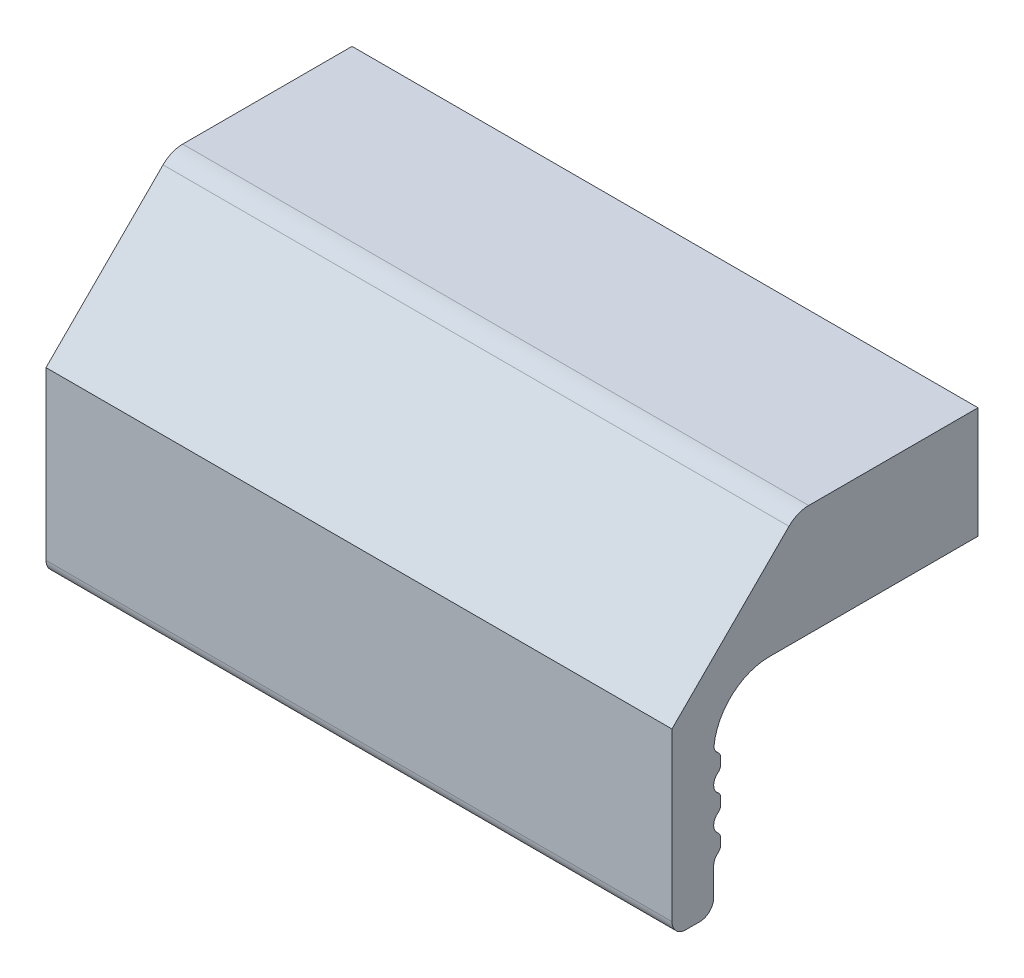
ISO-10303-21;
HEADER;
FILE_DESCRIPTION(('STEP AP214'),'2;1');
FILE_NAME('part.step','',(''),(''),'','','');
FILE_SCHEMA(('AUTOMOTIVE_DESIGN { 1 0 10303 214 1 1 1 1 }'));
ENDSEC;
DATA;
#1=APPLICATION_CONTEXT('core data for automotive mechanical design processes');
#2=APPLICATION_PROTOCOL_DEFINITION('international standard','automotive_design',2000,#1);
#3=PRODUCT_CONTEXT('',#1,'mechanical');
#4=PRODUCT('Part','Part','',(#3));
#5=PRODUCT_RELATED_PRODUCT_CATEGORY('part','',(#4));
#6=PRODUCT_DEFINITION_FORMATION('','',#4);
#7=PRODUCT_DEFINITION_CONTEXT('part definition',#1,'design');
#8=PRODUCT_DEFINITION('design','',#6,#7);
#9=PRODUCT_DEFINITION_SHAPE('','',#8);
#10=(LENGTH_UNIT() NAMED_UNIT(*) SI_UNIT(.MILLI.,.METRE.));
#11=(NAMED_UNIT(*) PLANE_ANGLE_UNIT() SI_UNIT($,.RADIAN.));
#12=(NAMED_UNIT(*) SI_UNIT($,.STERADIAN.) SOLID_ANGLE_UNIT());
#13=UNCERTAINTY_MEASURE_WITH_UNIT(LENGTH_MEASURE(1.E-05),#10,'distance_accuracy_value','');
#14=(GEOMETRIC_REPRESENTATION_CONTEXT(3) GLOBAL_UNCERTAINTY_ASSIGNED_CONTEXT((#13)) GLOBAL_UNIT_ASSIGNED_CONTEXT((#10,
#11,#12)) REPRESENTATION_CONTEXT('',''));
#15=CARTESIAN_POINT('',(0.,0.,0.));
#16=DIRECTION('',(0.,0.,1.));
#17=DIRECTION('',(1.,0.,0.));
#18=AXIS2_PLACEMENT_3D('',#15,#16,#17);
#19=CARTESIAN_POINT('',(37.5,-17.,22.));
#20=DIRECTION('',(0.,0.,1.));
#21=DIRECTION('',(1.,0.,0.));
#22=AXIS2_PLACEMENT_3D('',#19,#20,#21);
#23=PLANE('',#22);
#24=DIRECTION('',(-1.,0.,0.));
#25=VECTOR('',#24,1.);
#26=CARTESIAN_POINT('',(37.5,-17.,22.));
#27=LINE('',#26,#25);
#28=CARTESIAN_POINT('',(37.5,-17.,22.));
#29=VERTEX_POINT('',#28);
#30=CARTESIAN_POINT('',(-7.5,-17.,22.));
#31=VERTEX_POINT('',#30);
#32=EDGE_CURVE('E9',#29,#31,#27,.T.);
#33=ORIENTED_EDGE('',*,*,#32,.F.);
#34=DIRECTION('',(0.,1.,0.));
#35=VECTOR('',#34,1.);
#36=CARTESIAN_POINT('',(37.5,-17.,22.));
#37=LINE('',#36,#35);
#38=CARTESIAN_POINT('',(37.5,-5.,22.));
#39=VERTEX_POINT('',#38);
#40=EDGE_CURVE('E181',#29,#39,#37,.T.);
#41=ORIENTED_EDGE('',*,*,#40,.T.);
#42=DIRECTION('',(-1.,0.,0.));
#43=VECTOR('',#42,1.);
#44=CARTESIAN_POINT('',(37.5,-5.,22.));
#45=LINE('',#44,#43);
#46=CARTESIAN_POINT('',(-7.5,-5.,22.));
#47=VERTEX_POINT('',#46);
#48=EDGE_CURVE('E177',#39,#47,#45,.T.);
#49=ORIENTED_EDGE('',*,*,#48,.T.);
#50=DIRECTION('',(0.,1.,0.));
#51=VECTOR('',#50,1.);
#52=CARTESIAN_POINT('',(-7.5,-17.,22.));
#53=LINE('',#52,#51);
#54=EDGE_CURVE('E179',#31,#47,#53,.T.);
#55=ORIENTED_EDGE('',*,*,#54,.F.);
#56=EDGE_LOOP('',(#33,#41,#49,#55));
#57=FACE_BOUND('',#56,.T.);
#58=ADVANCED_FACE('F14',(#57),#23,.T.);
#59=CARTESIAN_POINT('',(37.5,-17.,21.));
#60=DIRECTION('',(-1.,0.,0.));
#61=DIRECTION('',(0.,0.,1.));
#62=AXIS2_PLACEMENT_3D('',#59,#60,#61);
#63=CYLINDRICAL_SURFACE('',#62,1.);
#64=DIRECTION('',(-1.,0.,0.));
#65=VECTOR('',#64,1.);
#66=CARTESIAN_POINT('',(37.5,-18.,21.));
#67=LINE('',#66,#65);
#68=CARTESIAN_POINT('',(37.5,-18.,21.));
#69=VERTEX_POINT('',#68);
#70=CARTESIAN_POINT('',(-7.5,-18.,21.));
#71=VERTEX_POINT('',#70);
#72=EDGE_CURVE('E22',#69,#71,#67,.T.);
#73=ORIENTED_EDGE('',*,*,#72,.F.);
#74=CARTESIAN_POINT('',(37.5,-17.,21.));
#75=DIRECTION('',(1.,0.,0.));
#76=DIRECTION('',(0.,0.,-1.));
#77=AXIS2_PLACEMENT_3D('',#74,#75,#76);
#78=CIRCLE('',#77,1.);
#79=EDGE_CURVE('E187',#29,#69,#78,.T.);
#80=ORIENTED_EDGE('',*,*,#79,.F.);
#81=ORIENTED_EDGE('',*,*,#32,.T.);
#82=CARTESIAN_POINT('',(-7.5,-17.,21.));
#83=DIRECTION('',(1.,0.,0.));
#84=DIRECTION('',(0.,0.,-1.));
#85=AXIS2_PLACEMENT_3D('',#82,#83,#84);
#86=CIRCLE('',#85,1.);
#87=EDGE_CURVE('E196',#31,#71,#86,.T.);
#88=ORIENTED_EDGE('',*,*,#87,.T.);
#89=EDGE_LOOP('',(#73,#80,#81,#88));
#90=FACE_BOUND('',#89,.T.);
#91=ADVANCED_FACE('F16',(#90),#63,.T.);
#92=CARTESIAN_POINT('',(37.5,-18.,20.));
#93=DIRECTION('',(0.,-1.,0.));
#94=DIRECTION('',(-1.,0.,0.));
#95=AXIS2_PLACEMENT_3D('',#92,#93,#94);
#96=PLANE('',#95);
#97=DIRECTION('',(-1.,0.,0.));
#98=VECTOR('',#97,1.);
#99=CARTESIAN_POINT('',(37.5,-18.,20.));
#100=LINE('',#99,#98);
#101=CARTESIAN_POINT('',(37.5,-18.,20.));
#102=VERTEX_POINT('',#101);
#103=CARTESIAN_POINT('',(-7.5,-18.,20.));
#104=VERTEX_POINT('',#103);
#105=EDGE_CURVE('E379',#102,#104,#100,.T.);
#106=ORIENTED_EDGE('',*,*,#105,.F.);
#107=DIRECTION('',(0.,0.,1.));
#108=VECTOR('',#107,1.);
#109=CARTESIAN_POINT('',(37.5,-18.,20.));
#110=LINE('',#109,#108);
#111=EDGE_CURVE('E334',#102,#69,#110,.T.);
#112=ORIENTED_EDGE('',*,*,#111,.T.);
#113=ORIENTED_EDGE('',*,*,#72,.T.);
#114=DIRECTION('',(0.,0.,1.));
#115=VECTOR('',#114,1.);
#116=CARTESIAN_POINT('',(-7.5,-18.,20.));
#117=LINE('',#116,#115);
#118=EDGE_CURVE('E265',#104,#71,#117,.T.);
#119=ORIENTED_EDGE('',*,*,#118,.F.);
#120=EDGE_LOOP('',(#106,#112,#113,#119));
#121=FACE_BOUND('',#120,.T.);
#122=ADVANCED_FACE('F382',(#121),#96,.T.);
#123=CARTESIAN_POINT('',(37.5,-17.,20.));
#124=DIRECTION('',(-1.,0.,0.));
#125=DIRECTION('',(0.,0.,1.));
#126=AXIS2_PLACEMENT_3D('',#123,#124,#125);
#127=CYLINDRICAL_SURFACE('',#126,1.);
#128=DIRECTION('',(-1.,0.,0.));
#129=VECTOR('',#128,1.);
#130=CARTESIAN_POINT('',(37.5,-17.,19.));
#131=LINE('',#130,#129);
#132=CARTESIAN_POINT('',(37.5,-17.,19.));
#133=VERTEX_POINT('',#132);
#134=CARTESIAN_POINT('',(-7.5,-17.,19.));
#135=VERTEX_POINT('',#134);
#136=EDGE_CURVE('E377',#133,#135,#131,.T.);
#137=ORIENTED_EDGE('',*,*,#136,.F.);
#138=CARTESIAN_POINT('',(37.5,-17.,20.));
#139=DIRECTION('',(1.,0.,0.));
#140=DIRECTION('',(0.,0.,-1.));
#141=AXIS2_PLACEMENT_3D('',#138,#139,#140);
#142=CIRCLE('',#141,1.);
#143=EDGE_CURVE('E331',#102,#133,#142,.T.);
#144=ORIENTED_EDGE('',*,*,#143,.F.);
#145=ORIENTED_EDGE('',*,*,#105,.T.);
#146=CARTESIAN_POINT('',(-7.5,-17.,20.));
#147=DIRECTION('',(1.,0.,0.));
#148=DIRECTION('',(0.,0.,-1.));
#149=AXIS2_PLACEMENT_3D('',#146,#147,#148);
#150=CIRCLE('',#149,1.);
#151=EDGE_CURVE('E262',#104,#135,#150,.T.);
#152=ORIENTED_EDGE('',*,*,#151,.T.);
#153=EDGE_LOOP('',(#137,#144,#145,#152));
#154=FACE_BOUND('',#153,.T.);
#155=ADVANCED_FACE('F468',(#154),#127,.T.);
#156=CARTESIAN_POINT('',(37.5,-17.,19.));
#157=DIRECTION('',(0.,-1.80411241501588E-13,1.));
#158=DIRECTION('',(0.,-1.,-1.80411241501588E-13));
#159=AXIS2_PLACEMENT_3D('',#156,#157,#158);
#160=PLANE('',#159);
#161=DIRECTION('',(-1.,0.,0.));
#162=VECTOR('',#161,1.);
#163=CARTESIAN_POINT('',(37.5,-15.,19.));
#164=LINE('',#163,#162);
#165=CARTESIAN_POINT('',(37.5,-15.,19.));
#166=VERTEX_POINT('',#165);
#167=CARTESIAN_POINT('',(-7.5,-15.,19.));
#168=VERTEX_POINT('',#167);
#169=EDGE_CURVE('E375',#166,#168,#164,.T.);
#170=ORIENTED_EDGE('',*,*,#169,.F.);
#171=DIRECTION('',(0.,1.,1.80411241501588E-13));
#172=VECTOR('',#171,1.);
#173=CARTESIAN_POINT('',(37.5,-17.,19.));
#174=LINE('',#173,#172);
#175=EDGE_CURVE('E328',#133,#166,#174,.T.);
#176=ORIENTED_EDGE('',*,*,#175,.F.);
#177=ORIENTED_EDGE('',*,*,#136,.T.);
#178=DIRECTION('',(0.,1.,1.80411241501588E-13));
#179=VECTOR('',#178,1.);
#180=CARTESIAN_POINT('',(-7.5,-17.,19.));
#181=LINE('',#180,#179);
#182=EDGE_CURVE('E259',#135,#168,#181,.T.);
#183=ORIENTED_EDGE('',*,*,#182,.T.);
#184=EDGE_LOOP('',(#170,#176,#177,#183));
#185=FACE_BOUND('',#184,.T.);
#186=ADVANCED_FACE('F464',(#185),#160,.F.);
#187=CARTESIAN_POINT('',(37.5,-15.,18.2));
#188=DIRECTION('',(-1.,0.,0.));
#189=DIRECTION('',(0.,0.,1.));
#190=AXIS2_PLACEMENT_3D('',#187,#188,#189);
#191=CYLINDRICAL_SURFACE('',#190,0.800000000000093);
#192=DIRECTION('',(-1.,0.,0.));
#193=VECTOR('',#192,1.);
#194=CARTESIAN_POINT('',(37.5,-14.3694184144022,18.6923076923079));
#195=LINE('',#194,#193);
#196=CARTESIAN_POINT('',(37.5,-14.3694184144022,18.6923076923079));
#197=VERTEX_POINT('',#196);
#198=CARTESIAN_POINT('',(-7.5,-14.3694184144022,18.6923076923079));
#199=VERTEX_POINT('',#198);
#200=EDGE_CURVE('E373',#197,#199,#195,.T.);
#201=ORIENTED_EDGE('',*,*,#200,.F.);
#202=CARTESIAN_POINT('',(37.5,-15.,18.2));
#203=DIRECTION('',(1.,0.,0.));
#204=DIRECTION('',(0.,0.,-1.));
#205=AXIS2_PLACEMENT_3D('',#202,#203,#204);
#206=CIRCLE('',#205,0.800000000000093);
#207=EDGE_CURVE('E325',#197,#166,#206,.T.);
#208=ORIENTED_EDGE('',*,*,#207,.T.);
#209=ORIENTED_EDGE('',*,*,#169,.T.);
#210=CARTESIAN_POINT('',(-7.5,-15.,18.2));
#211=DIRECTION('',(1.,0.,0.));
#212=DIRECTION('',(0.,0.,-1.));
#213=AXIS2_PLACEMENT_3D('',#210,#211,#212);
#214=CIRCLE('',#213,0.800000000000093);
#215=EDGE_CURVE('E256',#199,#168,#214,.T.);
#216=ORIENTED_EDGE('',*,*,#215,.F.);
#217=EDGE_LOOP('',(#201,#208,#209,#216));
#218=FACE_BOUND('',#217,.T.);
#219=ADVANCED_FACE('F462',(#218),#191,.F.);
#220=CARTESIAN_POINT('',(37.5,-13.9753049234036,19.));
#221=DIRECTION('',(-1.,0.,0.));
#222=DIRECTION('',(0.,0.,1.));
#223=AXIS2_PLACEMENT_3D('',#220,#221,#222);
#224=CYLINDRICAL_SURFACE('',#223,0.5);
#225=DIRECTION('',(-1.,0.,0.));
#226=VECTOR('',#225,1.);
#227=CARTESIAN_POINT('',(37.5,-13.9753049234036,18.5));
#228=LINE('',#227,#226);
#229=CARTESIAN_POINT('',(37.5,-13.9753049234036,18.5));
#230=VERTEX_POINT('',#229);
#231=CARTESIAN_POINT('',(-7.5,-13.9753049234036,18.5));
#232=VERTEX_POINT('',#231);
#233=EDGE_CURVE('E371',#230,#232,#228,.T.);
#234=ORIENTED_EDGE('',*,*,#233,.F.);
#235=CARTESIAN_POINT('',(37.5,-13.9753049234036,19.));
#236=DIRECTION('',(1.,0.,0.));
#237=DIRECTION('',(0.,0.,-1.));
#238=AXIS2_PLACEMENT_3D('',#235,#236,#237);
#239=CIRCLE('',#238,0.5);
#240=EDGE_CURVE('E322',#197,#230,#239,.T.);
#241=ORIENTED_EDGE('',*,*,#240,.F.);
#242=ORIENTED_EDGE('',*,*,#200,.T.);
#243=CARTESIAN_POINT('',(-7.5,-13.9753049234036,19.));
#244=DIRECTION('',(1.,0.,0.));
#245=DIRECTION('',(0.,0.,-1.));
#246=AXIS2_PLACEMENT_3D('',#243,#244,#245);
#247=CIRCLE('',#246,0.5);
#248=EDGE_CURVE('E253',#199,#232,#247,.T.);
#249=ORIENTED_EDGE('',*,*,#248,.T.);
#250=EDGE_LOOP('',(#234,#241,#242,#249));
#251=FACE_BOUND('',#250,.T.);
#252=ADVANCED_FACE('F458',(#251),#224,.T.);
#253=CARTESIAN_POINT('',(37.5,-13.9753049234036,18.5));
#254=DIRECTION('',(0.,0.,1.));
#255=DIRECTION('',(1.,0.,0.));
#256=AXIS2_PLACEMENT_3D('',#253,#254,#255);
#257=PLANE('',#256);
#258=DIRECTION('',(-1.,0.,0.));
#259=VECTOR('',#258,1.);
#260=CARTESIAN_POINT('',(37.5,-13.5246950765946,18.5));
#261=LINE('',#260,#259);
#262=CARTESIAN_POINT('',(37.5,-13.5246950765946,18.5));
#263=VERTEX_POINT('',#262);
#264=CARTESIAN_POINT('',(-7.5,-13.5246950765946,18.5));
#265=VERTEX_POINT('',#264);
#266=EDGE_CURVE('E369',#263,#265,#261,.T.);
#267=ORIENTED_EDGE('',*,*,#266,.F.);
#268=DIRECTION('',(0.,1.,0.));
#269=VECTOR('',#268,1.);
#270=CARTESIAN_POINT('',(37.5,-13.9753049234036,18.5));
#271=LINE('',#270,#269);
#272=EDGE_CURVE('E319',#230,#263,#271,.T.);
#273=ORIENTED_EDGE('',*,*,#272,.F.);
#274=ORIENTED_EDGE('',*,*,#233,.T.);
#275=DIRECTION('',(0.,1.,0.));
#276=VECTOR('',#275,1.);
#277=CARTESIAN_POINT('',(-7.5,-13.9753049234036,18.5));
#278=LINE('',#277,#276);
#279=EDGE_CURVE('E250',#232,#265,#278,.T.);
#280=ORIENTED_EDGE('',*,*,#279,.T.);
#281=EDGE_LOOP('',(#267,#273,#274,#280));
#282=FACE_BOUND('',#281,.T.);
#283=ADVANCED_FACE('F454',(#282),#257,.F.);
#284=CARTESIAN_POINT('',(37.5,-13.5246950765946,19.));
#285=DIRECTION('',(-1.,0.,0.));
#286=DIRECTION('',(0.,0.,1.));
#287=AXIS2_PLACEMENT_3D('',#284,#285,#286);
#288=CYLINDRICAL_SURFACE('',#287,0.499999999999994);
#289=DIRECTION('',(-1.,0.,0.));
#290=VECTOR('',#289,1.);
#291=CARTESIAN_POINT('',(37.5,-13.1305815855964,18.6923076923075));
#292=LINE('',#291,#290);
#293=CARTESIAN_POINT('',(37.5,-13.1305815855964,18.6923076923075));
#294=VERTEX_POINT('',#293);
#295=CARTESIAN_POINT('',(-7.5,-13.1305815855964,18.6923076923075));
#296=VERTEX_POINT('',#295);
#297=EDGE_CURVE('E367',#294,#296,#292,.T.);
#298=ORIENTED_EDGE('',*,*,#297,.F.);
#299=CARTESIAN_POINT('',(37.5,-13.5246950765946,19.));
#300=DIRECTION('',(1.,0.,0.));
#301=DIRECTION('',(0.,0.,-1.));
#302=AXIS2_PLACEMENT_3D('',#299,#300,#301);
#303=CIRCLE('',#302,0.499999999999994);
#304=EDGE_CURVE('E316',#263,#294,#303,.T.);
#305=ORIENTED_EDGE('',*,*,#304,.F.);
#306=ORIENTED_EDGE('',*,*,#266,.T.);
#307=CARTESIAN_POINT('',(-7.5,-13.5246950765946,19.));
#308=DIRECTION('',(1.,0.,0.));
#309=DIRECTION('',(0.,0.,-1.));
#310=AXIS2_PLACEMENT_3D('',#307,#308,#309);
#311=CIRCLE('',#310,0.499999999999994);
#312=EDGE_CURVE('E247',#265,#296,#311,.T.);
#313=ORIENTED_EDGE('',*,*,#312,.T.);
#314=EDGE_LOOP('',(#298,#305,#306,#313));
#315=FACE_BOUND('',#314,.T.);
#316=ADVANCED_FACE('F450',(#315),#288,.T.);
#317=CARTESIAN_POINT('',(37.5,-12.5,18.2));
#318=DIRECTION('',(-1.,0.,0.));
#319=DIRECTION('',(0.,0.,1.));
#320=AXIS2_PLACEMENT_3D('',#317,#318,#319);
#321=CYLINDRICAL_SURFACE('',#320,0.799999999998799);
#322=DIRECTION('',(-1.,0.,0.));
#323=VECTOR('',#322,1.);
#324=CARTESIAN_POINT('',(37.5,-11.8694184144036,18.6923076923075));
#325=LINE('',#324,#323);
#326=CARTESIAN_POINT('',(37.5,-11.8694184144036,18.6923076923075));
#327=VERTEX_POINT('',#326);
#328=CARTESIAN_POINT('',(-7.5,-11.8694184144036,18.6923076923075));
#329=VERTEX_POINT('',#328);
#330=EDGE_CURVE('E365',#327,#329,#325,.T.);
#331=ORIENTED_EDGE('',*,*,#330,.F.);
#332=CARTESIAN_POINT('',(37.5,-12.5,18.2));
#333=DIRECTION('',(1.,0.,0.));
#334=DIRECTION('',(0.,0.,-1.));
#335=AXIS2_PLACEMENT_3D('',#332,#333,#334);
#336=CIRCLE('',#335,0.799999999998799);
#337=EDGE_CURVE('E313',#327,#294,#336,.T.);
#338=ORIENTED_EDGE('',*,*,#337,.T.);
#339=ORIENTED_EDGE('',*,*,#297,.T.);
#340=CARTESIAN_POINT('',(-7.5,-12.5,18.2));
#341=DIRECTION('',(1.,0.,0.));
#342=DIRECTION('',(0.,0.,-1.));
#343=AXIS2_PLACEMENT_3D('',#340,#341,#342);
#344=CIRCLE('',#343,0.799999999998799);
#345=EDGE_CURVE('E244',#329,#296,#344,.T.);
#346=ORIENTED_EDGE('',*,*,#345,.F.);
#347=EDGE_LOOP('',(#331,#338,#339,#346));
#348=FACE_BOUND('',#347,.T.);
#349=ADVANCED_FACE('F446',(#348),#321,.F.);
#350=CARTESIAN_POINT('',(37.5,-11.4753049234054,19.));
#351=DIRECTION('',(-1.,0.,0.));
#352=DIRECTION('',(0.,0.,1.));
#353=AXIS2_PLACEMENT_3D('',#350,#351,#352);
#354=CYLINDRICAL_SURFACE('',#353,0.5);
#355=DIRECTION('',(-1.,0.,0.));
#356=VECTOR('',#355,1.);
#357=CARTESIAN_POINT('',(37.5,-11.4753049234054,18.5));
#358=LINE('',#357,#356);
#359=CARTESIAN_POINT('',(37.5,-11.4753049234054,18.5));
#360=VERTEX_POINT('',#359);
#361=CARTESIAN_POINT('',(-7.5,-11.4753049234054,18.5));
#362=VERTEX_POINT('',#361);
#363=EDGE_CURVE('E363',#360,#362,#358,.T.);
#364=ORIENTED_EDGE('',*,*,#363,.F.);
#365=CARTESIAN_POINT('',(37.5,-11.4753049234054,19.));
#366=DIRECTION('',(1.,0.,0.));
#367=DIRECTION('',(0.,0.,-1.));
#368=AXIS2_PLACEMENT_3D('',#365,#366,#367);
#369=CIRCLE('',#368,0.5);
#370=EDGE_CURVE('E310',#327,#360,#369,.T.);
#371=ORIENTED_EDGE('',*,*,#370,.F.);
#372=ORIENTED_EDGE('',*,*,#330,.T.);
#373=CARTESIAN_POINT('',(-7.5,-11.4753049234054,19.));
#374=DIRECTION('',(1.,0.,0.));
#375=DIRECTION('',(0.,0.,-1.));
#376=AXIS2_PLACEMENT_3D('',#373,#374,#375);
#377=CIRCLE('',#376,0.5);
#378=EDGE_CURVE('E241',#329,#362,#377,.T.);
#379=ORIENTED_EDGE('',*,*,#378,.T.);
#380=EDGE_LOOP('',(#364,#371,#372,#379));
#381=FACE_BOUND('',#380,.T.);
#382=ADVANCED_FACE('F442',(#381),#354,.T.);
#383=CARTESIAN_POINT('',(37.5,-11.4753049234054,18.5));
#384=DIRECTION('',(0.,0.,1.));
#385=DIRECTION('',(1.,0.,0.));
#386=AXIS2_PLACEMENT_3D('',#383,#384,#385);
#387=PLANE('',#386);
#388=DIRECTION('',(-1.,0.,0.));
#389=VECTOR('',#388,1.);
#390=CARTESIAN_POINT('',(37.5,-11.0246950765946,18.5));
#391=LINE('',#390,#389);
#392=CARTESIAN_POINT('',(37.5,-11.0246950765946,18.5));
#393=VERTEX_POINT('',#392);
#394=CARTESIAN_POINT('',(-7.5,-11.0246950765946,18.5));
#395=VERTEX_POINT('',#394);
#396=EDGE_CURVE('E361',#393,#395,#391,.T.);
#397=ORIENTED_EDGE('',*,*,#396,.F.);
#398=DIRECTION('',(0.,1.,0.));
#399=VECTOR('',#398,1.);
#400=CARTESIAN_POINT('',(37.5,-11.4753049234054,18.5));
#401=LINE('',#400,#399);
#402=EDGE_CURVE('E307',#360,#393,#401,.T.);
#403=ORIENTED_EDGE('',*,*,#402,.F.);
#404=ORIENTED_EDGE('',*,*,#363,.T.);
#405=DIRECTION('',(0.,1.,0.));
#406=VECTOR('',#405,1.);
#407=CARTESIAN_POINT('',(-7.5,-11.4753049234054,18.5));
#408=LINE('',#407,#406);
#409=EDGE_CURVE('E238',#362,#395,#408,.T.);
#410=ORIENTED_EDGE('',*,*,#409,.T.);
#411=EDGE_LOOP('',(#397,#403,#404,#410));
#412=FACE_BOUND('',#411,.T.);
#413=ADVANCED_FACE('F438',(#412),#387,.F.);
#414=CARTESIAN_POINT('',(37.5,-11.0246950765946,19.));
#415=DIRECTION('',(-1.,0.,0.));
#416=DIRECTION('',(0.,0.,1.));
#417=AXIS2_PLACEMENT_3D('',#414,#415,#416);
#418=CYLINDRICAL_SURFACE('',#417,0.499999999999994);
#419=DIRECTION('',(-1.,0.,0.));
#420=VECTOR('',#419,1.);
#421=CARTESIAN_POINT('',(37.5,-10.630581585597,18.692307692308));
#422=LINE('',#421,#420);
#423=CARTESIAN_POINT('',(37.5,-10.630581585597,18.692307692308));
#424=VERTEX_POINT('',#423);
#425=CARTESIAN_POINT('',(-7.5,-10.630581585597,18.692307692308));
#426=VERTEX_POINT('',#425);
#427=EDGE_CURVE('E359',#424,#426,#422,.T.);
#428=ORIENTED_EDGE('',*,*,#427,.F.);
#429=CARTESIAN_POINT('',(37.5,-11.0246950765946,19.));
#430=DIRECTION('',(1.,0.,0.));
#431=DIRECTION('',(0.,0.,-1.));
#432=AXIS2_PLACEMENT_3D('',#429,#430,#431);
#433=CIRCLE('',#432,0.499999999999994);
#434=EDGE_CURVE('E304',#393,#424,#433,.T.);
#435=ORIENTED_EDGE('',*,*,#434,.F.);
#436=ORIENTED_EDGE('',*,*,#396,.T.);
#437=CARTESIAN_POINT('',(-7.5,-11.0246950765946,19.));
#438=DIRECTION('',(1.,0.,0.));
#439=DIRECTION('',(0.,0.,-1.));
#440=AXIS2_PLACEMENT_3D('',#437,#438,#439);
#441=CIRCLE('',#440,0.499999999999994);
#442=EDGE_CURVE('E235',#395,#426,#441,.T.);
#443=ORIENTED_EDGE('',*,*,#442,.T.);
#444=EDGE_LOOP('',(#428,#435,#436,#443));
#445=FACE_BOUND('',#444,.T.);
#446=ADVANCED_FACE('F434',(#445),#418,.T.);
#447=CARTESIAN_POINT('',(37.5,-10.,18.2));
#448=DIRECTION('',(-1.,0.,0.));
#449=DIRECTION('',(0.,0.,1.));
#450=AXIS2_PLACEMENT_3D('',#447,#448,#449);
#451=CYLINDRICAL_SURFACE('',#450,0.799999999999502);
#452=DIRECTION('',(-1.,0.,0.));
#453=VECTOR('',#452,1.);
#454=CARTESIAN_POINT('',(37.5,-9.36941841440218,18.6923076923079));
#455=LINE('',#454,#453);
#456=CARTESIAN_POINT('',(37.5,-9.36941841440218,18.6923076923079));
#457=VERTEX_POINT('',#456);
#458=CARTESIAN_POINT('',(-7.5,-9.36941841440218,18.6923076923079));
#459=VERTEX_POINT('',#458);
#460=EDGE_CURVE('E357',#457,#459,#455,.T.);
#461=ORIENTED_EDGE('',*,*,#460,.F.);
#462=CARTESIAN_POINT('',(37.5,-10.,18.2));
#463=DIRECTION('',(1.,0.,0.));
#464=DIRECTION('',(0.,0.,-1.));
#465=AXIS2_PLACEMENT_3D('',#462,#463,#464);
#466=CIRCLE('',#465,0.799999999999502);
#467=EDGE_CURVE('E301',#457,#424,#466,.T.);
#468=ORIENTED_EDGE('',*,*,#467,.T.);
#469=ORIENTED_EDGE('',*,*,#427,.T.);
#470=CARTESIAN_POINT('',(-7.5,-10.,18.2));
#471=DIRECTION('',(1.,0.,0.));
#472=DIRECTION('',(0.,0.,-1.));
#473=AXIS2_PLACEMENT_3D('',#470,#471,#472);
#474=CIRCLE('',#473,0.799999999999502);
#475=EDGE_CURVE('E232',#459,#426,#474,.T.);
#476=ORIENTED_EDGE('',*,*,#475,.F.);
#477=EDGE_LOOP('',(#461,#468,#469,#476));
#478=FACE_BOUND('',#477,.T.);
#479=ADVANCED_FACE('F430',(#478),#451,.F.);
#480=CARTESIAN_POINT('',(37.5,-8.97530492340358,19.));
#481=DIRECTION('',(-1.,0.,0.));
#482=DIRECTION('',(0.,0.,1.));
#483=AXIS2_PLACEMENT_3D('',#480,#481,#482);
#484=CYLINDRICAL_SURFACE('',#483,0.5);
#485=DIRECTION('',(-1.,0.,0.));
#486=VECTOR('',#485,1.);
#487=CARTESIAN_POINT('',(37.5,-8.97530492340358,18.5));
#488=LINE('',#487,#486);
#489=CARTESIAN_POINT('',(37.5,-8.97530492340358,18.5));
#490=VERTEX_POINT('',#489);
#491=CARTESIAN_POINT('',(-7.5,-8.97530492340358,18.5));
#492=VERTEX_POINT('',#491);
#493=EDGE_CURVE('E355',#490,#492,#488,.T.);
#494=ORIENTED_EDGE('',*,*,#493,.F.);
#495=CARTESIAN_POINT('',(37.5,-8.97530492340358,19.));
#496=DIRECTION('',(1.,0.,0.));
#497=DIRECTION('',(0.,0.,-1.));
#498=AXIS2_PLACEMENT_3D('',#495,#496,#497);
#499=CIRCLE('',#498,0.5);
#500=EDGE_CURVE('E298',#457,#490,#499,.T.);
#501=ORIENTED_EDGE('',*,*,#500,.F.);
#502=ORIENTED_EDGE('',*,*,#460,.T.);
#503=CARTESIAN_POINT('',(-7.5,-8.97530492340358,19.));
#504=DIRECTION('',(1.,0.,0.));
#505=DIRECTION('',(0.,0.,-1.));
#506=AXIS2_PLACEMENT_3D('',#503,#504,#505);
#507=CIRCLE('',#506,0.5);
#508=EDGE_CURVE('E229',#459,#492,#507,.T.);
#509=ORIENTED_EDGE('',*,*,#508,.T.);
#510=EDGE_LOOP('',(#494,#501,#502,#509));
#511=FACE_BOUND('',#510,.T.);
#512=ADVANCED_FACE('F426',(#511),#484,.T.);
#513=CARTESIAN_POINT('',(37.5,-8.97530492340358,18.5));
#514=DIRECTION('',(0.,0.,1.));
#515=DIRECTION('',(1.,0.,0.));
#516=AXIS2_PLACEMENT_3D('',#513,#514,#515);
#517=PLANE('',#516);
#518=DIRECTION('',(-1.,0.,0.));
#519=VECTOR('',#518,1.);
#520=CARTESIAN_POINT('',(37.5,-8.52469507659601,18.5));
#521=LINE('',#520,#519);
#522=CARTESIAN_POINT('',(37.5,-8.52469507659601,18.5));
#523=VERTEX_POINT('',#522);
#524=CARTESIAN_POINT('',(-7.5,-8.52469507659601,18.5));
#525=VERTEX_POINT('',#524);
#526=EDGE_CURVE('E353',#523,#525,#521,.T.);
#527=ORIENTED_EDGE('',*,*,#526,.F.);
#528=DIRECTION('',(0.,1.,0.));
#529=VECTOR('',#528,1.);
#530=CARTESIAN_POINT('',(37.5,-8.97530492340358,18.5));
#531=LINE('',#530,#529);
#532=EDGE_CURVE('E295',#490,#523,#531,.T.);
#533=ORIENTED_EDGE('',*,*,#532,.F.);
#534=ORIENTED_EDGE('',*,*,#493,.T.);
#535=DIRECTION('',(0.,1.,0.));
#536=VECTOR('',#535,1.);
#537=CARTESIAN_POINT('',(-7.5,-8.97530492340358,18.5));
#538=LINE('',#537,#536);
#539=EDGE_CURVE('E226',#492,#525,#538,.T.);
#540=ORIENTED_EDGE('',*,*,#539,.T.);
#541=EDGE_LOOP('',(#527,#533,#534,#540));
#542=FACE_BOUND('',#541,.T.);
#543=ADVANCED_FACE('F422',(#542),#517,.F.);
#544=CARTESIAN_POINT('',(37.5,-8.52469507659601,19.));
#545=DIRECTION('',(-1.,0.,0.));
#546=DIRECTION('',(0.,0.,1.));
#547=AXIS2_PLACEMENT_3D('',#544,#545,#546);
#548=CYLINDRICAL_SURFACE('',#547,0.5);
#549=DIRECTION('',(-1.,0.,0.));
#550=VECTOR('',#549,1.);
#551=CARTESIAN_POINT('',(37.5,-8.1305815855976,18.6923076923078));
#552=LINE('',#551,#550);
#553=CARTESIAN_POINT('',(37.5,-8.1305815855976,18.6923076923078));
#554=VERTEX_POINT('',#553);
#555=CARTESIAN_POINT('',(-7.5,-8.1305815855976,18.6923076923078));
#556=VERTEX_POINT('',#555);
#557=EDGE_CURVE('E351',#554,#556,#552,.T.);
#558=ORIENTED_EDGE('',*,*,#557,.F.);
#559=CARTESIAN_POINT('',(37.5,-8.52469507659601,19.));
#560=DIRECTION('',(1.,0.,0.));
#561=DIRECTION('',(0.,0.,-1.));
#562=AXIS2_PLACEMENT_3D('',#559,#560,#561);
#563=CIRCLE('',#562,0.5);
#564=EDGE_CURVE('E292',#523,#554,#563,.T.);
#565=ORIENTED_EDGE('',*,*,#564,.F.);
#566=ORIENTED_EDGE('',*,*,#526,.T.);
#567=CARTESIAN_POINT('',(-7.5,-8.52469507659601,19.));
#568=DIRECTION('',(1.,0.,0.));
#569=DIRECTION('',(0.,0.,-1.));
#570=AXIS2_PLACEMENT_3D('',#567,#568,#569);
#571=CIRCLE('',#570,0.5);
#572=EDGE_CURVE('E223',#525,#556,#571,.T.);
#573=ORIENTED_EDGE('',*,*,#572,.T.);
#574=EDGE_LOOP('',(#558,#565,#566,#573));
#575=FACE_BOUND('',#574,.T.);
#576=ADVANCED_FACE('F418',(#575),#548,.T.);
#577=CARTESIAN_POINT('',(37.5,-7.5,18.2));
#578=DIRECTION('',(-1.,0.,0.));
#579=DIRECTION('',(0.,0.,1.));
#580=AXIS2_PLACEMENT_3D('',#577,#578,#579);
#581=CYLINDRICAL_SURFACE('',#580,0.799999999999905);
#582=DIRECTION('',(-1.,0.,0.));
#583=VECTOR('',#582,1.);
#584=CARTESIAN_POINT('',(37.5,-7.7980536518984,18.9424042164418));
#585=LINE('',#584,#583);
#586=CARTESIAN_POINT('',(37.5,-7.7980536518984,18.9424042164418));
#587=VERTEX_POINT('',#586);
#588=CARTESIAN_POINT('',(-7.5,-7.7980536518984,18.9424042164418));
#589=VERTEX_POINT('',#588);
#590=EDGE_CURVE('E349',#587,#589,#585,.T.);
#591=ORIENTED_EDGE('',*,*,#590,.F.);
#592=CARTESIAN_POINT('',(37.5,-7.5,18.2));
#593=DIRECTION('',(1.,0.,0.));
#594=DIRECTION('',(0.,0.,-1.));
#595=AXIS2_PLACEMENT_3D('',#592,#593,#594);
#596=CIRCLE('',#595,0.799999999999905);
#597=EDGE_CURVE('E289',#587,#554,#596,.T.);
#598=ORIENTED_EDGE('',*,*,#597,.T.);
#599=ORIENTED_EDGE('',*,*,#557,.T.);
#600=CARTESIAN_POINT('',(-7.5,-7.5,18.2));
#601=DIRECTION('',(1.,0.,0.));
#602=DIRECTION('',(0.,0.,-1.));
#603=AXIS2_PLACEMENT_3D('',#600,#601,#602);
#604=CIRCLE('',#603,0.799999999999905);
#605=EDGE_CURVE('E220',#589,#556,#604,.T.);
#606=ORIENTED_EDGE('',*,*,#605,.F.);
#607=EDGE_LOOP('',(#591,#598,#599,#606));
#608=FACE_BOUND('',#607,.T.);
#609=ADVANCED_FACE('F414',(#608),#581,.F.);
#610=CARTESIAN_POINT('',(37.5,-7.61177011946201,18.4784015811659));
#611=DIRECTION('',(-1.,0.,0.));
#612=DIRECTION('',(0.,0.,1.));
#613=AXIS2_PLACEMENT_3D('',#610,#611,#612);
#614=CYLINDRICAL_SURFACE('',#613,0.5);
#615=DIRECTION('',(-1.,0.,0.));
#616=VECTOR('',#615,1.);
#617=CARTESIAN_POINT('',(37.5,-7.55630870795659,18.975316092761));
#618=LINE('',#617,#616);
#619=CARTESIAN_POINT('',(37.5,-7.55630870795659,18.975316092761));
#620=VERTEX_POINT('',#619);
#621=CARTESIAN_POINT('',(-7.5,-7.55630870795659,18.975316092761));
#622=VERTEX_POINT('',#621);
#623=EDGE_CURVE('E347',#620,#622,#618,.T.);
#624=ORIENTED_EDGE('',*,*,#623,.F.);
#625=CARTESIAN_POINT('',(37.5,-7.61177011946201,18.4784015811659));
#626=DIRECTION('',(1.,0.,0.));
#627=DIRECTION('',(0.,0.,-1.));
#628=AXIS2_PLACEMENT_3D('',#625,#626,#627);
#629=CIRCLE('',#628,0.5);
#630=EDGE_CURVE('E286',#620,#587,#629,.T.);
#631=ORIENTED_EDGE('',*,*,#630,.T.);
#632=ORIENTED_EDGE('',*,*,#590,.T.);
#633=CARTESIAN_POINT('',(-7.5,-7.61177011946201,18.4784015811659));
#634=DIRECTION('',(1.,0.,0.));
#635=DIRECTION('',(0.,0.,-1.));
#636=AXIS2_PLACEMENT_3D('',#633,#634,#635);
#637=CIRCLE('',#636,0.5);
#638=EDGE_CURVE('E217',#622,#589,#637,.T.);
#639=ORIENTED_EDGE('',*,*,#638,.F.);
#640=EDGE_LOOP('',(#624,#631,#632,#639));
#641=FACE_BOUND('',#640,.T.);
#642=ADVANCED_FACE('F411',(#641),#614,.F.);
#643=CARTESIAN_POINT('',(37.5,-8.,15.));
#644=DIRECTION('',(-1.,0.,0.));
#645=DIRECTION('',(0.,0.,1.));
#646=AXIS2_PLACEMENT_3D('',#643,#644,#645);
#647=CYLINDRICAL_SURFACE('',#646,4.);
#648=DIRECTION('',(-1.,0.,0.));
#649=VECTOR('',#648,1.);
#650=CARTESIAN_POINT('',(37.5,-4.,15.));
#651=LINE('',#650,#649);
#652=CARTESIAN_POINT('',(37.5,-4.,15.));
#653=VERTEX_POINT('',#652);
#654=CARTESIAN_POINT('',(-7.5,-4.,15.));
#655=VERTEX_POINT('',#654);
#656=EDGE_CURVE('E345',#653,#655,#651,.T.);
#657=ORIENTED_EDGE('',*,*,#656,.F.);
#658=CARTESIAN_POINT('',(37.5,-8.,15.));
#659=DIRECTION('',(1.,0.,0.));
#660=DIRECTION('',(0.,0.,-1.));
#661=AXIS2_PLACEMENT_3D('',#658,#659,#660);
#662=CIRCLE('',#661,4.);
#663=EDGE_CURVE('E283',#653,#620,#662,.T.);
#664=ORIENTED_EDGE('',*,*,#663,.T.);
#665=ORIENTED_EDGE('',*,*,#623,.T.);
#666=CARTESIAN_POINT('',(-7.5,-8.,15.));
#667=DIRECTION('',(1.,0.,0.));
#668=DIRECTION('',(0.,0.,-1.));
#669=AXIS2_PLACEMENT_3D('',#666,#667,#668);
#670=CIRCLE('',#669,4.);
#671=EDGE_CURVE('E214',#655,#622,#670,.T.);
#672=ORIENTED_EDGE('',*,*,#671,.F.);
#673=EDGE_LOOP('',(#657,#664,#665,#672));
#674=FACE_BOUND('',#673,.T.);
#675=ADVANCED_FACE('F406',(#674),#647,.F.);
#676=CARTESIAN_POINT('',(37.5,-4.,0.));
#677=DIRECTION('',(0.,-1.,0.));
#678=DIRECTION('',(-1.,0.,0.));
#679=AXIS2_PLACEMENT_3D('',#676,#677,#678);
#680=PLANE('',#679);
#681=DIRECTION('',(-1.,0.,0.));
#682=VECTOR('',#681,1.);
#683=CARTESIAN_POINT('',(37.5,-4.,0.));
#684=LINE('',#683,#682);
#685=CARTESIAN_POINT('',(37.5,-4.,0.));
#686=VERTEX_POINT('',#685);
#687=CARTESIAN_POINT('',(-7.5,-4.,0.));
#688=VERTEX_POINT('',#687);
#689=EDGE_CURVE('E343',#686,#688,#684,.T.);
#690=ORIENTED_EDGE('',*,*,#689,.F.);
#691=DIRECTION('',(0.,0.,1.));
#692=VECTOR('',#691,1.);
#693=CARTESIAN_POINT('',(37.5,-4.,0.));
#694=LINE('',#693,#692);
#695=EDGE_CURVE('E280',#686,#653,#694,.T.);
#696=ORIENTED_EDGE('',*,*,#695,.T.);
#697=ORIENTED_EDGE('',*,*,#656,.T.);
#698=DIRECTION('',(0.,0.,1.));
#699=VECTOR('',#698,1.);
#700=CARTESIAN_POINT('',(-7.5,-4.,0.));
#701=LINE('',#700,#699);
#702=EDGE_CURVE('E211',#688,#655,#701,.T.);
#703=ORIENTED_EDGE('',*,*,#702,.F.);
#704=EDGE_LOOP('',(#690,#696,#697,#703));
#705=FACE_BOUND('',#704,.T.);
#706=ADVANCED_FACE('F403',(#705),#680,.T.);
#707=CARTESIAN_POINT('',(37.5,4.,0.));
#708=DIRECTION('',(0.,0.,-1.));
#709=DIRECTION('',(-1.,0.,0.));
#710=AXIS2_PLACEMENT_3D('',#707,#708,#709);
#711=PLANE('',#710);
#712=CARTESIAN_POINT('',(0.,0.,0.));
#713=DIRECTION('',(0.,0.,-1.));
#714=DIRECTION('',(-1.,0.,0.));
#715=AXIS2_PLACEMENT_3D('',#712,#713,#714);
#716=CIRCLE('',#715,2.);
#717=CARTESIAN_POINT('',(-2.,0.,0.));
#718=VERTEX_POINT('',#717);
#719=EDGE_CURVE('E736',#718,#718,#716,.T.);
#720=ORIENTED_EDGE('',*,*,#719,.F.);
#721=EDGE_LOOP('',(#720));
#722=FACE_BOUND('',#721,.T.);
#723=CARTESIAN_POINT('',(30.,0.,0.));
#724=DIRECTION('',(0.,0.,-1.));
#725=DIRECTION('',(-1.,0.,0.));
#726=AXIS2_PLACEMENT_3D('',#723,#724,#725);
#727=CIRCLE('',#726,2.);
#728=CARTESIAN_POINT('',(28.,0.,0.));
#729=VERTEX_POINT('',#728);
#730=EDGE_CURVE('E735',#729,#729,#727,.T.);
#731=ORIENTED_EDGE('',*,*,#730,.F.);
#732=EDGE_LOOP('',(#731));
#733=FACE_BOUND('',#732,.T.);
#734=DIRECTION('',(-1.,0.,0.));
#735=VECTOR('',#734,1.);
#736=CARTESIAN_POINT('',(37.5,4.,0.));
#737=LINE('',#736,#735);
#738=CARTESIAN_POINT('',(37.5,4.,0.));
#739=VERTEX_POINT('',#738);
#740=CARTESIAN_POINT('',(-7.5,4.,0.));
#741=VERTEX_POINT('',#740);
#742=EDGE_CURVE('E341',#739,#741,#737,.T.);
#743=ORIENTED_EDGE('',*,*,#742,.F.);
#744=DIRECTION('',(0.,-1.,0.));
#745=VECTOR('',#744,1.);
#746=CARTESIAN_POINT('',(37.5,4.,0.));
#747=LINE('',#746,#745);
#748=EDGE_CURVE('E277',#739,#686,#747,.T.);
#749=ORIENTED_EDGE('',*,*,#748,.T.);
#750=ORIENTED_EDGE('',*,*,#689,.T.);
#751=DIRECTION('',(0.,-1.,0.));
#752=VECTOR('',#751,1.);
#753=CARTESIAN_POINT('',(-7.5,4.,0.));
#754=LINE('',#753,#752);
#755=EDGE_CURVE('E208',#741,#688,#754,.T.);
#756=ORIENTED_EDGE('',*,*,#755,.F.);
#757=EDGE_LOOP('',(#743,#749,#750,#756));
#758=FACE_BOUND('',#757,.T.);
#759=ADVANCED_FACE('F398',(#722,#733,#758),#711,.T.);
#760=CARTESIAN_POINT('',(37.5,4.,12.1715728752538));
#761=DIRECTION('',(0.,1.,0.));
#762=DIRECTION('',(1.,0.,0.));
#763=AXIS2_PLACEMENT_3D('',#760,#761,#762);
#764=PLANE('',#763);
#765=DIRECTION('',(-1.,0.,0.));
#766=VECTOR('',#765,1.);
#767=CARTESIAN_POINT('',(37.5,4.,12.1715728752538));
#768=LINE('',#767,#766);
#769=CARTESIAN_POINT('',(37.5,4.,12.1715728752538));
#770=VERTEX_POINT('',#769);
#771=CARTESIAN_POINT('',(-7.5,4.,12.1715728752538));
#772=VERTEX_POINT('',#771);
#773=EDGE_CURVE('E339',#770,#772,#768,.T.);
#774=ORIENTED_EDGE('',*,*,#773,.F.);
#775=DIRECTION('',(0.,0.,-1.));
#776=VECTOR('',#775,1.);
#777=CARTESIAN_POINT('',(37.5,4.,12.1715728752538));
#778=LINE('',#777,#776);
#779=EDGE_CURVE('E274',#770,#739,#778,.T.);
#780=ORIENTED_EDGE('',*,*,#779,.T.);
#781=ORIENTED_EDGE('',*,*,#742,.T.);
#782=DIRECTION('',(0.,0.,-1.));
#783=VECTOR('',#782,1.);
#784=CARTESIAN_POINT('',(-7.5,4.,12.1715728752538));
#785=LINE('',#784,#783);
#786=EDGE_CURVE('E202',#772,#741,#785,.T.);
#787=ORIENTED_EDGE('',*,*,#786,.F.);
#788=EDGE_LOOP('',(#774,#780,#781,#787));
#789=FACE_BOUND('',#788,.T.);
#790=ADVANCED_FACE('F396',(#789),#764,.T.);
#791=CARTESIAN_POINT('',(37.5,2.,12.1715728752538));
#792=DIRECTION('',(-1.,0.,0.));
#793=DIRECTION('',(0.,0.,1.));
#794=AXIS2_PLACEMENT_3D('',#791,#792,#793);
#795=CYLINDRICAL_SURFACE('',#794,2.);
#796=DIRECTION('',(-1.,0.,0.));
#797=VECTOR('',#796,1.);
#798=CARTESIAN_POINT('',(37.5,3.41421356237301,13.5857864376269));
#799=LINE('',#798,#797);
#800=CARTESIAN_POINT('',(37.5,3.41421356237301,13.5857864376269));
#801=VERTEX_POINT('',#800);
#802=CARTESIAN_POINT('',(-7.5,3.41421356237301,13.5857864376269));
#803=VERTEX_POINT('',#802);
#804=EDGE_CURVE('E186',#801,#803,#799,.T.);
#805=ORIENTED_EDGE('',*,*,#804,.F.);
#806=CARTESIAN_POINT('',(37.5,2.,12.1715728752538));
#807=DIRECTION('',(1.,0.,0.));
#808=DIRECTION('',(0.,0.,-1.));
#809=AXIS2_PLACEMENT_3D('',#806,#807,#808);
#810=CIRCLE('',#809,2.);
#811=EDGE_CURVE('E271',#770,#801,#810,.T.);
#812=ORIENTED_EDGE('',*,*,#811,.F.);
#813=ORIENTED_EDGE('',*,*,#773,.T.);
#814=CARTESIAN_POINT('',(-7.5,2.,12.1715728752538));
#815=DIRECTION('',(1.,0.,0.));
#816=DIRECTION('',(0.,0.,-1.));
#817=AXIS2_PLACEMENT_3D('',#814,#815,#816);
#818=CIRCLE('',#817,2.);
#819=EDGE_CURVE('E200',#772,#803,#818,.T.);
#820=ORIENTED_EDGE('',*,*,#819,.T.);
#821=EDGE_LOOP('',(#805,#812,#813,#820));
#822=FACE_BOUND('',#821,.T.);
#823=ADVANCED_FACE('F392',(#822),#795,.T.);
#824=CARTESIAN_POINT('',(37.5,-5.,22.));
#825=DIRECTION('',(0.,0.707106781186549,0.707106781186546));
#826=DIRECTION('',(0.,-0.707106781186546,0.707106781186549));
#827=AXIS2_PLACEMENT_3D('',#824,#825,#826);
#828=PLANE('',#827);
#829=DIRECTION('',(0.,0.707106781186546,-0.707106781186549));
#830=VECTOR('',#829,1.);
#831=CARTESIAN_POINT('',(37.5,-5.,22.));
#832=LINE('',#831,#830);
#833=EDGE_CURVE('E269',#39,#801,#832,.T.);
#834=ORIENTED_EDGE('',*,*,#833,.T.);
#835=ORIENTED_EDGE('',*,*,#804,.T.);
#836=DIRECTION('',(0.,0.707106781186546,-0.707106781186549));
#837=VECTOR('',#836,1.);
#838=CARTESIAN_POINT('',(-7.5,-5.,22.));
#839=LINE('',#838,#837);
#840=EDGE_CURVE('E193',#47,#803,#839,.T.);
#841=ORIENTED_EDGE('',*,*,#840,.F.);
#842=ORIENTED_EDGE('',*,*,#48,.F.);
#843=EDGE_LOOP('',(#834,#835,#841,#842));
#844=FACE_BOUND('',#843,.T.);
#845=ADVANCED_FACE('F199',(#844),#828,.T.);
#846=CARTESIAN_POINT('',(37.5,2.,12.1715728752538));
#847=DIRECTION('',(1.,0.,0.));
#848=DIRECTION('',(0.,0.,-1.));
#849=AXIS2_PLACEMENT_3D('',#846,#847,#848);
#850=PLANE('',#849);
#851=ORIENTED_EDGE('',*,*,#40,.F.);
#852=ORIENTED_EDGE('',*,*,#79,.T.);
#853=ORIENTED_EDGE('',*,*,#111,.F.);
#854=ORIENTED_EDGE('',*,*,#143,.T.);
#855=ORIENTED_EDGE('',*,*,#175,.T.);
#856=ORIENTED_EDGE('',*,*,#207,.F.);
#857=ORIENTED_EDGE('',*,*,#240,.T.);
#858=ORIENTED_EDGE('',*,*,#272,.T.);
#859=ORIENTED_EDGE('',*,*,#304,.T.);
#860=ORIENTED_EDGE('',*,*,#337,.F.);
#861=ORIENTED_EDGE('',*,*,#370,.T.);
#862=ORIENTED_EDGE('',*,*,#402,.T.);
#863=ORIENTED_EDGE('',*,*,#434,.T.);
#864=ORIENTED_EDGE('',*,*,#467,.F.);
#865=ORIENTED_EDGE('',*,*,#500,.T.);
#866=ORIENTED_EDGE('',*,*,#532,.T.);
#867=ORIENTED_EDGE('',*,*,#564,.T.);
#868=ORIENTED_EDGE('',*,*,#597,.F.);
#869=ORIENTED_EDGE('',*,*,#630,.F.);
#870=ORIENTED_EDGE('',*,*,#663,.F.);
#871=ORIENTED_EDGE('',*,*,#695,.F.);
#872=ORIENTED_EDGE('',*,*,#748,.F.);
#873=ORIENTED_EDGE('',*,*,#779,.F.);
#874=ORIENTED_EDGE('',*,*,#811,.T.);
#875=ORIENTED_EDGE('',*,*,#833,.F.);
#876=EDGE_LOOP('',(#851,#852,#853,#854,#855,#856,#857,#858,#859,#860,#861,#862,#863,#864,#865,
#866,#867,#868,#869,#870,#871,#872,#873,#874,#875));
#877=FACE_BOUND('',#876,.T.);
#878=ADVANCED_FACE('F387',(#877),#850,.T.);
#879=CARTESIAN_POINT('',(-7.5,2.,12.1715728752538));
#880=DIRECTION('',(1.,0.,0.));
#881=DIRECTION('',(0.,0.,-1.));
#882=AXIS2_PLACEMENT_3D('',#879,#880,#881);
#883=PLANE('',#882);
#884=ORIENTED_EDGE('',*,*,#54,.T.);
#885=ORIENTED_EDGE('',*,*,#840,.T.);
#886=ORIENTED_EDGE('',*,*,#819,.F.);
#887=ORIENTED_EDGE('',*,*,#786,.T.);
#888=ORIENTED_EDGE('',*,*,#755,.T.);
#889=ORIENTED_EDGE('',*,*,#702,.T.);
#890=ORIENTED_EDGE('',*,*,#671,.T.);
#891=ORIENTED_EDGE('',*,*,#638,.T.);
#892=ORIENTED_EDGE('',*,*,#605,.T.);
#893=ORIENTED_EDGE('',*,*,#572,.F.);
#894=ORIENTED_EDGE('',*,*,#539,.F.);
#895=ORIENTED_EDGE('',*,*,#508,.F.);
#896=ORIENTED_EDGE('',*,*,#475,.T.);
#897=ORIENTED_EDGE('',*,*,#442,.F.);
#898=ORIENTED_EDGE('',*,*,#409,.F.);
#899=ORIENTED_EDGE('',*,*,#378,.F.);
#900=ORIENTED_EDGE('',*,*,#345,.T.);
#901=ORIENTED_EDGE('',*,*,#312,.F.);
#902=ORIENTED_EDGE('',*,*,#279,.F.);
#903=ORIENTED_EDGE('',*,*,#248,.F.);
#904=ORIENTED_EDGE('',*,*,#215,.T.);
#905=ORIENTED_EDGE('',*,*,#182,.F.);
#906=ORIENTED_EDGE('',*,*,#151,.F.);
#907=ORIENTED_EDGE('',*,*,#118,.T.);
#908=ORIENTED_EDGE('',*,*,#87,.F.);
#909=EDGE_LOOP('',(#884,#885,#886,#887,#888,#889,#890,#891,#892,#893,#894,#895,#896,#897,#898,
#899,#900,#901,#902,#903,#904,#905,#906,#907,#908));
#910=FACE_BOUND('',#909,.T.);
#911=ADVANCED_FACE('F191',(#910),#883,.F.);
#912=CARTESIAN_POINT('',(30.,0.,8.));
#913=DIRECTION('',(0.,0.,-1.));
#914=DIRECTION('',(-1.,0.,0.));
#915=AXIS2_PLACEMENT_3D('',#912,#913,#914);
#916=CYLINDRICAL_SURFACE('',#915,2.);
#917=CARTESIAN_POINT('',(30.,0.,8.));
#918=DIRECTION('',(0.,0.,-1.));
#919=DIRECTION('',(-1.,0.,0.));
#920=AXIS2_PLACEMENT_3D('',#917,#918,#919);
#921=CIRCLE('',#920,2.);
#922=CARTESIAN_POINT('',(28.,0.,8.));
#923=VERTEX_POINT('',#922);
#924=EDGE_CURVE('E197',#923,#923,#921,.T.);
#925=ORIENTED_EDGE('',*,*,#924,.F.);
#926=EDGE_LOOP('',(#925));
#927=FACE_BOUND('',#926,.T.);
#928=ORIENTED_EDGE('',*,*,#730,.T.);
#929=EDGE_LOOP('',(#928));
#930=FACE_BOUND('',#929,.T.);
#931=ADVANCED_FACE('F645',(#927,#930),#916,.F.);
#932=CARTESIAN_POINT('',(30.,0.,8.));
#933=DIRECTION('',(0.,0.,-1.));
#934=DIRECTION('',(-1.,0.,0.));
#935=AXIS2_PLACEMENT_3D('',#932,#933,#934);
#936=PLANE('',#935);
#937=ORIENTED_EDGE('',*,*,#924,.T.);
#938=EDGE_LOOP('',(#937));
#939=FACE_BOUND('',#938,.T.);
#940=ADVANCED_FACE('F646',(#939),#936,.T.);
#941=CARTESIAN_POINT('',(0.,0.,8.));
#942=DIRECTION('',(0.,0.,-1.));
#943=DIRECTION('',(-1.,0.,0.));
#944=AXIS2_PLACEMENT_3D('',#941,#942,#943);
#945=CYLINDRICAL_SURFACE('',#944,2.);
#946=CARTESIAN_POINT('',(0.,0.,8.));
#947=DIRECTION('',(0.,0.,-1.));
#948=DIRECTION('',(-1.,0.,0.));
#949=AXIS2_PLACEMENT_3D('',#946,#947,#948);
#950=CIRCLE('',#949,2.);
#951=CARTESIAN_POINT('',(-2.,0.,8.));
#952=VERTEX_POINT('',#951);
#953=EDGE_CURVE('E734',#952,#952,#950,.T.);
#954=ORIENTED_EDGE('',*,*,#953,.F.);
#955=EDGE_LOOP('',(#954));
#956=FACE_BOUND('',#955,.T.);
#957=ORIENTED_EDGE('',*,*,#719,.T.);
#958=EDGE_LOOP('',(#957));
#959=FACE_BOUND('',#958,.T.);
#960=ADVANCED_FACE('F662',(#956,#959),#945,.F.);
#961=CARTESIAN_POINT('',(0.,0.,8.));
#962=DIRECTION('',(0.,0.,-1.));
#963=DIRECTION('',(-1.,0.,0.));
#964=AXIS2_PLACEMENT_3D('',#961,#962,#963);
#965=PLANE('',#964);
#966=ORIENTED_EDGE('',*,*,#953,.T.);
#967=EDGE_LOOP('',(#966));
#968=FACE_BOUND('',#967,.T.);
#969=ADVANCED_FACE('F655',(#968),#965,.T.);
#970=CLOSED_SHELL('',(#58,#91,#122,#155,#186,#219,#252,#283,#316,#349,#382,#413,#446,#479,#512,
#543,#576,#609,#642,#675,#706,#759,#790,#823,#845,#878,#911,#931,#940,#960,#969));
#971=MANIFOLD_SOLID_BREP('B1',#970);
#972=ADVANCED_BREP_SHAPE_REPRESENTATION('',(#18,#971),#14);
#973=SHAPE_DEFINITION_REPRESENTATION(#9,#972);
ENDSEC;
END-ISO-10303-21;
